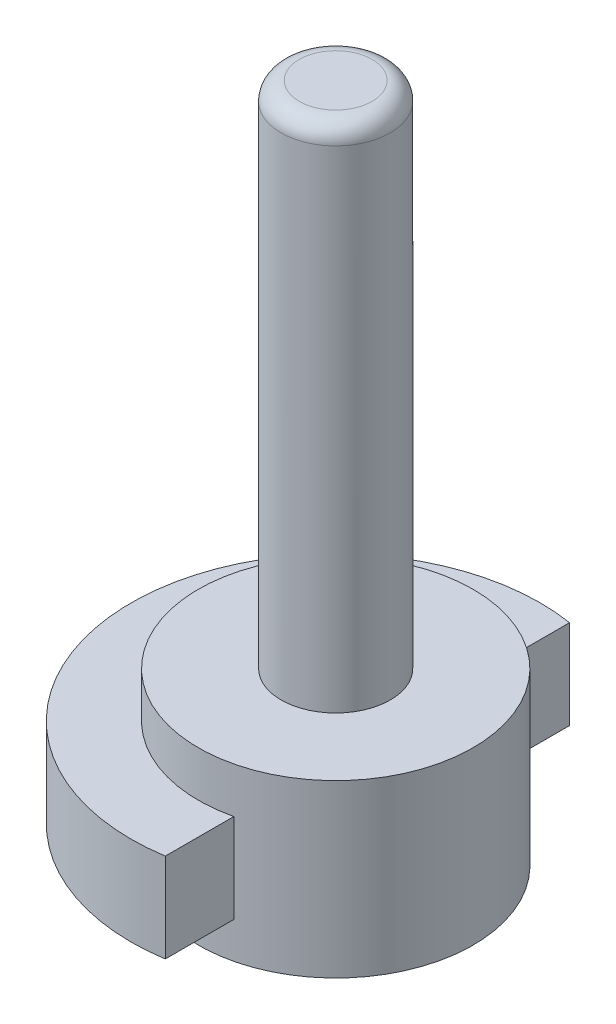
from build123d import *

# Parameters (mm, degrees)
SKETCH1_R           = 3
BOSS_EXTRUDE1_DEPTH = 28
SKETCH2_R           = 7.55
BOSS_EXTRUDE2_DEPTH = 2.5
FILLET2_R           = 1
SKETCH3_R           = 11.25
BOSS_EXTRUDE3_DEPTH = 4.9
SKETCH5_R           = 7.55
BOSS_EXTRUDE5_DEPTH = 2
CUT_EXTRUDE1_DEPTH  = 10
CUT_EXTRUDE2_DEPTH  = 10


with BuildPart() as part:
    # Sketch1 → Boss-Extrude1 (new body)
    with BuildSketch(Plane(origin=(0, 0, 0), x_dir=(1, 0, 0), z_dir=(0, 1, 0))):
        with Locations(Location((0, 0, 0), (0, 0, 90))):
            Circle(SKETCH1_R)
    extrude(amount=BOSS_EXTRUDE1_DEPTH)

    # Sketch2 → Boss-Extrude2 (add)
    with BuildSketch(Plane(origin=(0, 0, 0), x_dir=(-1, 0, 0), z_dir=(0, -1, 0))):
        with Locations(Location((0, 0, 0), (0, 0, 90))):
            Circle(SKETCH2_R)
    extrude(amount=BOSS_EXTRUDE2_DEPTH)

    # Fillet2
    fillet2_edges = [part.edges().sort_by_distance(p)[0] for p in [
        (0, 28, 3),
    ]]
    fillet(fillet2_edges, radius=FILLET2_R)

    # Sketch3 → Boss-Extrude3 (add)
    with BuildSketch(Plane(origin=(0, -2.5, 0), x_dir=(-1, 0, 0), z_dir=(0, -1, 0))):
        with Locations(Location((0, 0, 0), (0, 0, 90))):
            Circle(SKETCH3_R)
    extrude(amount=BOSS_EXTRUDE3_DEPTH)

    # Sketch5 → Boss-Extrude5 (add)
    with BuildSketch(Plane.XZ.offset(7.4)):
        with Locations(Location((0, 0, 0), (0, 0, 270))):
            Circle(SKETCH5_R)
    extrude(amount=BOSS_EXTRUDE5_DEPTH)

    # Sketch6 → Cut-Extrude1 (cut)
    with BuildSketch(Plane(origin=(0, -2.5, 0), x_dir=(1, 0, 0), z_dir=(0, 1, 0))):
        with BuildLine():
            Line((1.746254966, -7.345276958), (17.270816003, -7.345276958))
            Line((17.270816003, -7.345276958), (17.270816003, 7.345276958))
            Line((17.270816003, 7.345276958), (1.746254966, 7.345276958))
            ThreePointArc((1.746254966, 7.345276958), (7.55, 0), (1.746254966, -7.345276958))
        make_face()
    extrude(amount=-CUT_EXTRUDE1_DEPTH, mode=Mode.SUBTRACT)

    # Sketch8 → Cut-Extrude2 (cut)
    with BuildSketch(Plane(origin=(0, -2.5, 0), x_dir=(1, 0, 0), z_dir=(0, 1, 0))):
        with BuildLine():
            Line((8.521115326, 7.345276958), (1.746254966, 7.345276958))
            Line((1.746254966, 7.345276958), (1.746254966, 11.113644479))
            ThreePointArc((1.746254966, 11.113644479), (5.468534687, 9.831461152), (8.521115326, 7.345276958))
        make_face()
        with BuildLine():
            Line((1.746254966, -7.345276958), (8.521115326, -7.345276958))
            ThreePointArc((8.521115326, -7.345276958), (5.468534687, -9.831461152), (1.746254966, -11.113644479))
            Line((1.746254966, -11.113644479), (1.746254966, -7.345276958))
        make_face()
    extrude(amount=-CUT_EXTRUDE2_DEPTH, mode=Mode.SUBTRACT)


solid = part.part
